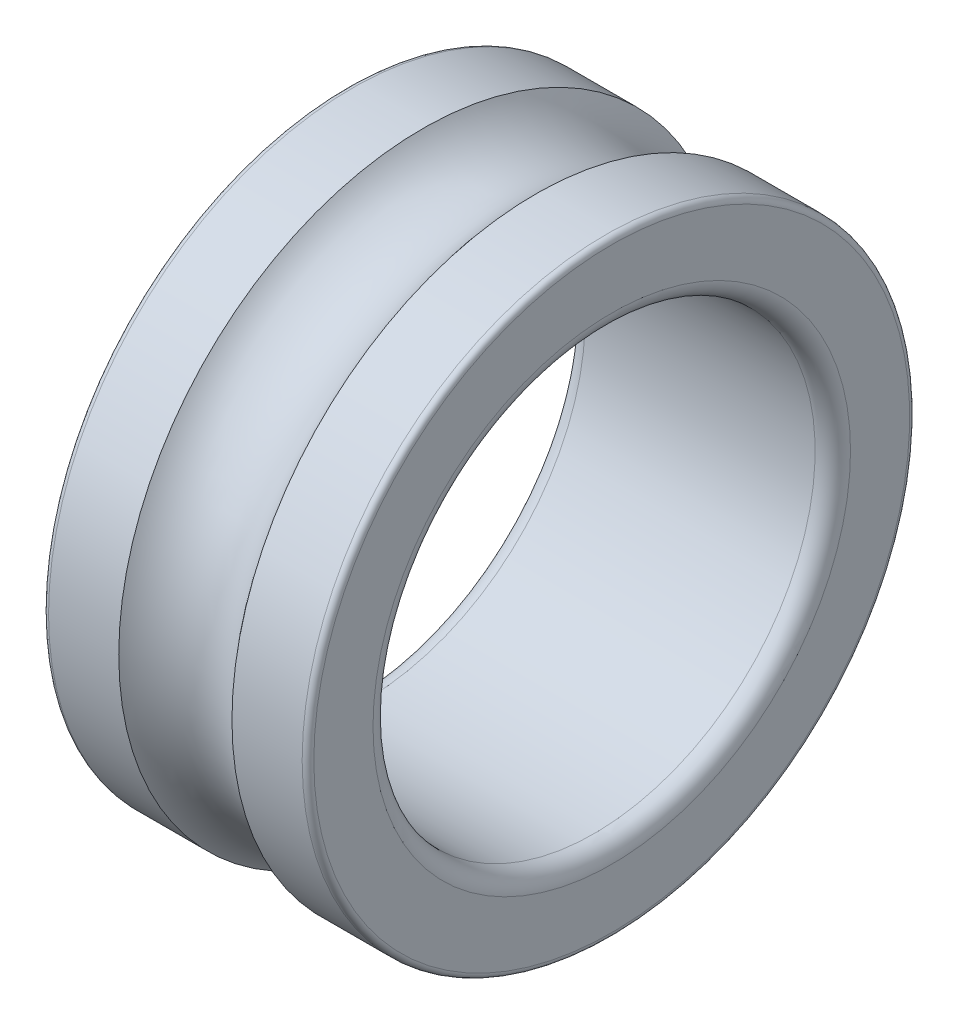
from build123d import *


with BuildPart() as part:
    # Skica1 → Rotovat1 (revolve)
    with BuildSketch(Plane.XY, mode=Mode.PRIVATE) as rotovat1_sk:
        with BuildLine():
            Line((15, 13.5), (15, 16.845))
            ThreePointArc((15, 16.845), (14.903345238, 17.078345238), (14.67, 17.175))
            Line((14.67, 17.175), (10.7, 17.175))
            ThreePointArc((10.7, 17.175), (7.5, 15.553969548), (4.3, 17.175))
            Line((4.3, 17.175), (0.33, 17.175))
            ThreePointArc((0.33, 17.175), (0.096654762, 17.078345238), (0, 16.845))
            Line((0, 16.845), (0, 13.5))
            ThreePointArc((0, 13.5), (0.292893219, 12.792893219), (1, 12.5))
            Line((1, 12.5), (14, 12.5))
            ThreePointArc((14, 12.5), (14.707106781, 12.792893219), (15, 13.5))
        make_face()
    revolve(rotovat1_sk.sketch.rotate(Axis((0, 0, 0), (1, 0, 0)), 90), axis=Axis((0, 0, 0), (1, 0, 0)))


solid = part.part
